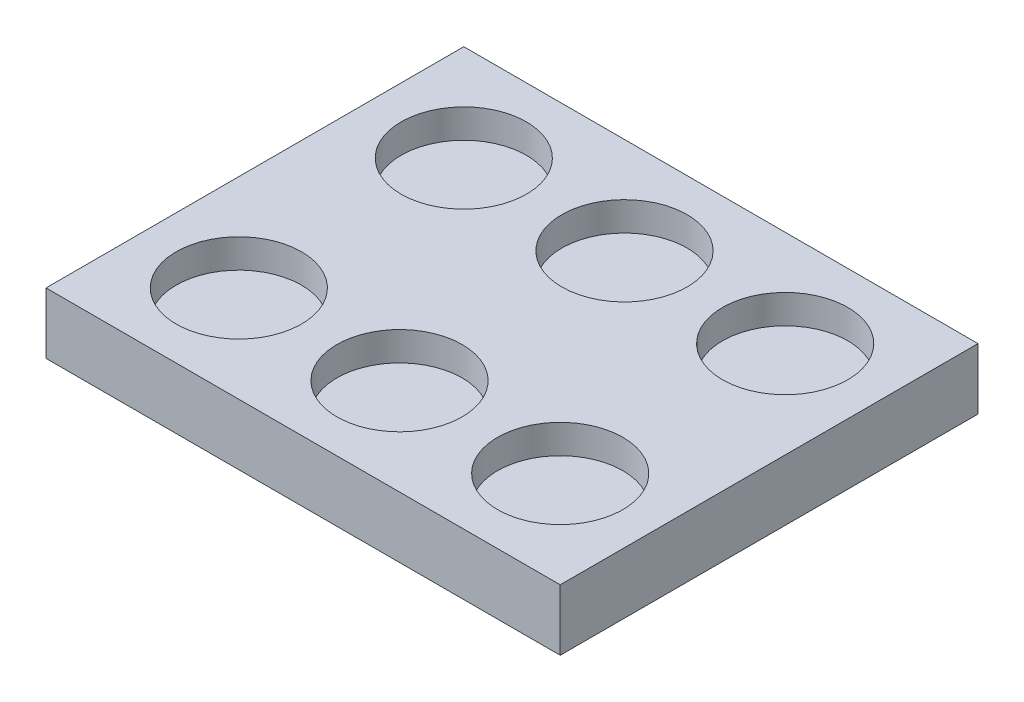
ISO-10303-21;
HEADER;
FILE_DESCRIPTION(('STEP AP214'),'2;1');
FILE_NAME('part.step','',(''),(''),'','','');
FILE_SCHEMA(('AUTOMOTIVE_DESIGN { 1 0 10303 214 1 1 1 1 }'));
ENDSEC;
DATA;
#1=APPLICATION_CONTEXT('core data for automotive mechanical design processes');
#2=APPLICATION_PROTOCOL_DEFINITION('international standard','automotive_design',2000,#1);
#3=PRODUCT_CONTEXT('',#1,'mechanical');
#4=PRODUCT('Part','Part','',(#3));
#5=PRODUCT_RELATED_PRODUCT_CATEGORY('part','',(#4));
#6=PRODUCT_DEFINITION_FORMATION('','',#4);
#7=PRODUCT_DEFINITION_CONTEXT('part definition',#1,'design');
#8=PRODUCT_DEFINITION('design','',#6,#7);
#9=PRODUCT_DEFINITION_SHAPE('','',#8);
#10=(LENGTH_UNIT() NAMED_UNIT(*) SI_UNIT(.MILLI.,.METRE.));
#11=(NAMED_UNIT(*) PLANE_ANGLE_UNIT() SI_UNIT($,.RADIAN.));
#12=(NAMED_UNIT(*) SI_UNIT($,.STERADIAN.) SOLID_ANGLE_UNIT());
#13=UNCERTAINTY_MEASURE_WITH_UNIT(LENGTH_MEASURE(1.E-05),#10,'distance_accuracy_value','');
#14=(GEOMETRIC_REPRESENTATION_CONTEXT(3) GLOBAL_UNCERTAINTY_ASSIGNED_CONTEXT((#13)) GLOBAL_UNIT_ASSIGNED_CONTEXT((#10,
#11,#12)) REPRESENTATION_CONTEXT('',''));
#15=CARTESIAN_POINT('',(0.,0.,0.));
#16=DIRECTION('',(0.,0.,1.));
#17=DIRECTION('',(1.,0.,0.));
#18=AXIS2_PLACEMENT_3D('',#15,#16,#17);
#19=CARTESIAN_POINT('',(0.,1.8,0.));
#20=DIRECTION('',(0.,1.,0.));
#21=DIRECTION('',(0.,0.,1.));
#22=AXIS2_PLACEMENT_3D('',#19,#20,#21);
#23=PLANE('',#22);
#24=CARTESIAN_POINT('',(9.,1.8,7.));
#25=DIRECTION('',(0.,1.,0.));
#26=DIRECTION('',(0.,0.,-1.));
#27=AXIS2_PLACEMENT_3D('',#24,#25,#26);
#28=CIRCLE('',#27,3.9);
#29=CARTESIAN_POINT('',(9.,1.8,3.1));
#30=VERTEX_POINT('',#29);
#31=EDGE_CURVE('E109',#30,#30,#28,.T.);
#32=ORIENTED_EDGE('',*,*,#31,.F.);
#33=EDGE_LOOP('',(#32));
#34=FACE_BOUND('',#33,.T.);
#35=CARTESIAN_POINT('',(-11.,1.8,7.));
#36=DIRECTION('',(0.,1.,0.));
#37=DIRECTION('',(0.,0.,-1.));
#38=AXIS2_PLACEMENT_3D('',#35,#36,#37);
#39=CIRCLE('',#38,3.9);
#40=CARTESIAN_POINT('',(-11.,1.8,3.1));
#41=VERTEX_POINT('',#40);
#42=EDGE_CURVE('E121',#41,#41,#39,.T.);
#43=ORIENTED_EDGE('',*,*,#42,.F.);
#44=EDGE_LOOP('',(#43));
#45=FACE_BOUND('',#44,.T.);
#46=CARTESIAN_POINT('',(-11.,1.8,-7.));
#47=DIRECTION('',(0.,1.,0.));
#48=DIRECTION('',(0.,0.,1.));
#49=AXIS2_PLACEMENT_3D('',#46,#47,#48);
#50=CIRCLE('',#49,3.9);
#51=CARTESIAN_POINT('',(-11.,1.8,-3.1));
#52=VERTEX_POINT('',#51);
#53=EDGE_CURVE('E133',#52,#52,#50,.T.);
#54=ORIENTED_EDGE('',*,*,#53,.F.);
#55=EDGE_LOOP('',(#54));
#56=FACE_BOUND('',#55,.T.);
#57=DIRECTION('',(0.,0.,1.));
#58=VECTOR('',#57,1.);
#59=CARTESIAN_POINT('',(-17.,1.8,-13.));
#60=LINE('',#59,#58);
#61=CARTESIAN_POINT('',(-17.,1.8,-13.));
#62=VERTEX_POINT('',#61);
#63=CARTESIAN_POINT('',(-17.,1.8,13.));
#64=VERTEX_POINT('',#63);
#65=EDGE_CURVE('E82',#62,#64,#60,.T.);
#66=ORIENTED_EDGE('',*,*,#65,.T.);
#67=DIRECTION('',(1.,0.,0.));
#68=VECTOR('',#67,1.);
#69=CARTESIAN_POINT('',(-17.,1.8,13.));
#70=LINE('',#69,#68);
#71=CARTESIAN_POINT('',(15.,1.8,13.));
#72=VERTEX_POINT('',#71);
#73=EDGE_CURVE('E139',#64,#72,#70,.T.);
#74=ORIENTED_EDGE('',*,*,#73,.T.);
#75=DIRECTION('',(0.,0.,-1.));
#76=VECTOR('',#75,1.);
#77=CARTESIAN_POINT('',(15.,1.8,-13.));
#78=LINE('',#77,#76);
#79=CARTESIAN_POINT('',(15.,1.8,-13.));
#80=VERTEX_POINT('',#79);
#81=EDGE_CURVE('E57',#72,#80,#78,.T.);
#82=ORIENTED_EDGE('',*,*,#81,.T.);
#83=DIRECTION('',(-1.,0.,0.));
#84=VECTOR('',#83,1.);
#85=CARTESIAN_POINT('',(-17.,1.8,-13.));
#86=LINE('',#85,#84);
#87=EDGE_CURVE('E52',#80,#62,#86,.T.);
#88=ORIENTED_EDGE('',*,*,#87,.T.);
#89=EDGE_LOOP('',(#66,#74,#82,#88));
#90=FACE_BOUND('',#89,.T.);
#91=CARTESIAN_POINT('',(9.,1.8,-7.));
#92=DIRECTION('',(0.,1.,0.));
#93=DIRECTION('',(0.,0.,1.));
#94=AXIS2_PLACEMENT_3D('',#91,#92,#93);
#95=CIRCLE('',#94,3.9);
#96=CARTESIAN_POINT('',(9.,1.8,-3.1));
#97=VERTEX_POINT('',#96);
#98=EDGE_CURVE('E127',#97,#97,#95,.T.);
#99=ORIENTED_EDGE('',*,*,#98,.F.);
#100=EDGE_LOOP('',(#99));
#101=FACE_BOUND('',#100,.T.);
#102=CARTESIAN_POINT('',(-1.,1.8,7.));
#103=DIRECTION('',(0.,1.,0.));
#104=DIRECTION('',(0.,0.,-1.));
#105=AXIS2_PLACEMENT_3D('',#102,#103,#104);
#106=CIRCLE('',#105,3.9);
#107=CARTESIAN_POINT('',(-1.,1.8,3.1));
#108=VERTEX_POINT('',#107);
#109=EDGE_CURVE('E115',#108,#108,#106,.T.);
#110=ORIENTED_EDGE('',*,*,#109,.F.);
#111=EDGE_LOOP('',(#110));
#112=FACE_BOUND('',#111,.T.);
#113=CARTESIAN_POINT('',(-1.,1.8,-7.));
#114=DIRECTION('',(0.,1.,0.));
#115=DIRECTION('',(0.,0.,1.));
#116=AXIS2_PLACEMENT_3D('',#113,#114,#115);
#117=CIRCLE('',#116,3.9);
#118=CARTESIAN_POINT('',(-1.,1.8,-3.1));
#119=VERTEX_POINT('',#118);
#120=EDGE_CURVE('E103',#119,#119,#117,.T.);
#121=ORIENTED_EDGE('',*,*,#120,.F.);
#122=EDGE_LOOP('',(#121));
#123=FACE_BOUND('',#122,.T.);
#124=ADVANCED_FACE('F37',(#34,#45,#56,#90,#101,#112,#123),#23,.T.);
#125=CARTESIAN_POINT('',(-17.,1.8,-13.));
#126=DIRECTION('',(1.,0.,0.));
#127=DIRECTION('',(0.,0.,-1.));
#128=AXIS2_PLACEMENT_3D('',#125,#126,#127);
#129=PLANE('',#128);
#130=DIRECTION('',(0.,-1.,0.));
#131=VECTOR('',#130,1.);
#132=CARTESIAN_POINT('',(-17.,1.8,-13.));
#133=LINE('',#132,#131);
#134=CARTESIAN_POINT('',(-17.,-2.,-13.));
#135=VERTEX_POINT('',#134);
#136=EDGE_CURVE('E77',#62,#135,#133,.T.);
#137=ORIENTED_EDGE('',*,*,#136,.T.);
#138=DIRECTION('',(0.,0.,-1.));
#139=VECTOR('',#138,1.);
#140=CARTESIAN_POINT('',(-17.,-2.,13.));
#141=LINE('',#140,#139);
#142=CARTESIAN_POINT('',(-17.,-2.,13.));
#143=VERTEX_POINT('',#142);
#144=EDGE_CURVE('E81',#143,#135,#141,.T.);
#145=ORIENTED_EDGE('',*,*,#144,.F.);
#146=DIRECTION('',(0.,-1.,0.));
#147=VECTOR('',#146,1.);
#148=CARTESIAN_POINT('',(-17.,1.8,13.));
#149=LINE('',#148,#147);
#150=EDGE_CURVE('E11',#64,#143,#149,.T.);
#151=ORIENTED_EDGE('',*,*,#150,.F.);
#152=ORIENTED_EDGE('',*,*,#65,.F.);
#153=EDGE_LOOP('',(#137,#145,#151,#152));
#154=FACE_BOUND('',#153,.T.);
#155=ADVANCED_FACE('F39',(#154),#129,.F.);
#156=CARTESIAN_POINT('',(-17.,1.8,13.));
#157=DIRECTION('',(0.,0.,-1.));
#158=DIRECTION('',(-1.,0.,0.));
#159=AXIS2_PLACEMENT_3D('',#156,#157,#158);
#160=PLANE('',#159);
#161=ORIENTED_EDGE('',*,*,#150,.T.);
#162=DIRECTION('',(-1.,0.,0.));
#163=VECTOR('',#162,1.);
#164=CARTESIAN_POINT('',(-17.,-2.,13.));
#165=LINE('',#164,#163);
#166=CARTESIAN_POINT('',(15.,-2.,13.));
#167=VERTEX_POINT('',#166);
#168=EDGE_CURVE('E97',#167,#143,#165,.T.);
#169=ORIENTED_EDGE('',*,*,#168,.F.);
#170=DIRECTION('',(0.,-1.,0.));
#171=VECTOR('',#170,1.);
#172=CARTESIAN_POINT('',(15.,1.8,13.));
#173=LINE('',#172,#171);
#174=EDGE_CURVE('E45',#72,#167,#173,.T.);
#175=ORIENTED_EDGE('',*,*,#174,.F.);
#176=ORIENTED_EDGE('',*,*,#73,.F.);
#177=EDGE_LOOP('',(#161,#169,#175,#176));
#178=FACE_BOUND('',#177,.T.);
#179=ADVANCED_FACE('F147',(#178),#160,.F.);
#180=CARTESIAN_POINT('',(15.,1.8,-13.));
#181=DIRECTION('',(-1.,0.,0.));
#182=DIRECTION('',(0.,0.,1.));
#183=AXIS2_PLACEMENT_3D('',#180,#181,#182);
#184=PLANE('',#183);
#185=ORIENTED_EDGE('',*,*,#174,.T.);
#186=DIRECTION('',(0.,0.,1.));
#187=VECTOR('',#186,1.);
#188=CARTESIAN_POINT('',(15.,-2.,13.));
#189=LINE('',#188,#187);
#190=CARTESIAN_POINT('',(15.,-2.,-13.));
#191=VERTEX_POINT('',#190);
#192=EDGE_CURVE('E92',#191,#167,#189,.T.);
#193=ORIENTED_EDGE('',*,*,#192,.F.);
#194=DIRECTION('',(0.,-1.,0.));
#195=VECTOR('',#194,1.);
#196=CARTESIAN_POINT('',(15.,1.8,-13.));
#197=LINE('',#196,#195);
#198=EDGE_CURVE('E84',#80,#191,#197,.T.);
#199=ORIENTED_EDGE('',*,*,#198,.F.);
#200=ORIENTED_EDGE('',*,*,#81,.F.);
#201=EDGE_LOOP('',(#185,#193,#199,#200));
#202=FACE_BOUND('',#201,.T.);
#203=ADVANCED_FACE('F145',(#202),#184,.F.);
#204=CARTESIAN_POINT('',(-17.,1.8,-13.));
#205=DIRECTION('',(0.,0.,1.));
#206=DIRECTION('',(1.,0.,0.));
#207=AXIS2_PLACEMENT_3D('',#204,#205,#206);
#208=PLANE('',#207);
#209=ORIENTED_EDGE('',*,*,#198,.T.);
#210=DIRECTION('',(1.,0.,0.));
#211=VECTOR('',#210,1.);
#212=CARTESIAN_POINT('',(-17.,-2.,-13.));
#213=LINE('',#212,#211);
#214=EDGE_CURVE('E87',#135,#191,#213,.T.);
#215=ORIENTED_EDGE('',*,*,#214,.F.);
#216=ORIENTED_EDGE('',*,*,#136,.F.);
#217=ORIENTED_EDGE('',*,*,#87,.F.);
#218=EDGE_LOOP('',(#209,#215,#216,#217));
#219=FACE_BOUND('',#218,.T.);
#220=ADVANCED_FACE('F88',(#219),#208,.F.);
#221=CARTESIAN_POINT('',(-11.,1.8,-7.));
#222=DIRECTION('',(0.,-1.,0.));
#223=DIRECTION('',(0.,0.,-1.));
#224=AXIS2_PLACEMENT_3D('',#221,#222,#223);
#225=CYLINDRICAL_SURFACE('',#224,3.9);
#226=ORIENTED_EDGE('',*,*,#53,.T.);
#227=EDGE_LOOP('',(#226));
#228=FACE_BOUND('',#227,.T.);
#229=CARTESIAN_POINT('',(-11.,0.,-7.));
#230=DIRECTION('',(0.,1.,0.));
#231=DIRECTION('',(0.,0.,1.));
#232=AXIS2_PLACEMENT_3D('',#229,#230,#231);
#233=CIRCLE('',#232,3.9);
#234=CARTESIAN_POINT('',(-11.,0.,-3.1));
#235=VERTEX_POINT('',#234);
#236=EDGE_CURVE('E130',#235,#235,#233,.T.);
#237=ORIENTED_EDGE('',*,*,#236,.F.);
#238=EDGE_LOOP('',(#237));
#239=FACE_BOUND('',#238,.T.);
#240=ADVANCED_FACE('F187',(#228,#239),#225,.F.);
#241=CARTESIAN_POINT('',(9.,1.8,-7.));
#242=DIRECTION('',(0.,-1.,0.));
#243=DIRECTION('',(0.,0.,-1.));
#244=AXIS2_PLACEMENT_3D('',#241,#242,#243);
#245=CYLINDRICAL_SURFACE('',#244,3.9);
#246=ORIENTED_EDGE('',*,*,#98,.T.);
#247=EDGE_LOOP('',(#246));
#248=FACE_BOUND('',#247,.T.);
#249=CARTESIAN_POINT('',(9.,0.,-7.));
#250=DIRECTION('',(0.,1.,0.));
#251=DIRECTION('',(0.,0.,1.));
#252=AXIS2_PLACEMENT_3D('',#249,#250,#251);
#253=CIRCLE('',#252,3.9);
#254=CARTESIAN_POINT('',(9.,0.,-3.1));
#255=VERTEX_POINT('',#254);
#256=EDGE_CURVE('E124',#255,#255,#253,.T.);
#257=ORIENTED_EDGE('',*,*,#256,.F.);
#258=EDGE_LOOP('',(#257));
#259=FACE_BOUND('',#258,.T.);
#260=ADVANCED_FACE('F189',(#248,#259),#245,.F.);
#261=CARTESIAN_POINT('',(-11.,1.8,7.));
#262=DIRECTION('',(0.,-1.,0.));
#263=DIRECTION('',(0.,0.,-1.));
#264=AXIS2_PLACEMENT_3D('',#261,#262,#263);
#265=CYLINDRICAL_SURFACE('',#264,3.9);
#266=ORIENTED_EDGE('',*,*,#42,.T.);
#267=EDGE_LOOP('',(#266));
#268=FACE_BOUND('',#267,.T.);
#269=CARTESIAN_POINT('',(-11.,0.,7.));
#270=DIRECTION('',(0.,1.,0.));
#271=DIRECTION('',(0.,0.,-1.));
#272=AXIS2_PLACEMENT_3D('',#269,#270,#271);
#273=CIRCLE('',#272,3.9);
#274=CARTESIAN_POINT('',(-11.,0.,3.1));
#275=VERTEX_POINT('',#274);
#276=EDGE_CURVE('E118',#275,#275,#273,.T.);
#277=ORIENTED_EDGE('',*,*,#276,.F.);
#278=EDGE_LOOP('',(#277));
#279=FACE_BOUND('',#278,.T.);
#280=ADVANCED_FACE('F196',(#268,#279),#265,.F.);
#281=CARTESIAN_POINT('',(-1.,1.8,7.));
#282=DIRECTION('',(0.,-1.,0.));
#283=DIRECTION('',(0.,0.,-1.));
#284=AXIS2_PLACEMENT_3D('',#281,#282,#283);
#285=CYLINDRICAL_SURFACE('',#284,3.9);
#286=ORIENTED_EDGE('',*,*,#109,.T.);
#287=EDGE_LOOP('',(#286));
#288=FACE_BOUND('',#287,.T.);
#289=CARTESIAN_POINT('',(-1.,0.,7.));
#290=DIRECTION('',(0.,1.,0.));
#291=DIRECTION('',(0.,0.,-1.));
#292=AXIS2_PLACEMENT_3D('',#289,#290,#291);
#293=CIRCLE('',#292,3.9);
#294=CARTESIAN_POINT('',(-1.,0.,3.1));
#295=VERTEX_POINT('',#294);
#296=EDGE_CURVE('E112',#295,#295,#293,.T.);
#297=ORIENTED_EDGE('',*,*,#296,.F.);
#298=EDGE_LOOP('',(#297));
#299=FACE_BOUND('',#298,.T.);
#300=ADVANCED_FACE('F238',(#288,#299),#285,.F.);
#301=CARTESIAN_POINT('',(9.,1.8,7.));
#302=DIRECTION('',(0.,-1.,0.));
#303=DIRECTION('',(0.,0.,-1.));
#304=AXIS2_PLACEMENT_3D('',#301,#302,#303);
#305=CYLINDRICAL_SURFACE('',#304,3.9);
#306=ORIENTED_EDGE('',*,*,#31,.T.);
#307=EDGE_LOOP('',(#306));
#308=FACE_BOUND('',#307,.T.);
#309=CARTESIAN_POINT('',(9.,0.,7.));
#310=DIRECTION('',(0.,1.,0.));
#311=DIRECTION('',(0.,0.,-1.));
#312=AXIS2_PLACEMENT_3D('',#309,#310,#311);
#313=CIRCLE('',#312,3.9);
#314=CARTESIAN_POINT('',(9.,0.,3.1));
#315=VERTEX_POINT('',#314);
#316=EDGE_CURVE('E106',#315,#315,#313,.T.);
#317=ORIENTED_EDGE('',*,*,#316,.F.);
#318=EDGE_LOOP('',(#317));
#319=FACE_BOUND('',#318,.T.);
#320=ADVANCED_FACE('F162',(#308,#319),#305,.F.);
#321=CARTESIAN_POINT('',(-1.,1.8,-7.));
#322=DIRECTION('',(0.,-1.,0.));
#323=DIRECTION('',(0.,0.,-1.));
#324=AXIS2_PLACEMENT_3D('',#321,#322,#323);
#325=CYLINDRICAL_SURFACE('',#324,3.9);
#326=ORIENTED_EDGE('',*,*,#120,.T.);
#327=EDGE_LOOP('',(#326));
#328=FACE_BOUND('',#327,.T.);
#329=CARTESIAN_POINT('',(-1.,0.,-7.));
#330=DIRECTION('',(0.,1.,0.));
#331=DIRECTION('',(0.,0.,1.));
#332=AXIS2_PLACEMENT_3D('',#329,#330,#331);
#333=CIRCLE('',#332,3.9);
#334=CARTESIAN_POINT('',(-1.,0.,-3.1));
#335=VERTEX_POINT('',#334);
#336=EDGE_CURVE('E102',#335,#335,#333,.T.);
#337=ORIENTED_EDGE('',*,*,#336,.F.);
#338=EDGE_LOOP('',(#337));
#339=FACE_BOUND('',#338,.T.);
#340=ADVANCED_FACE('F158',(#328,#339),#325,.F.);
#341=CARTESIAN_POINT('',(0.,0.,0.));
#342=DIRECTION('',(0.,-1.,0.));
#343=DIRECTION('',(0.,0.,-1.));
#344=AXIS2_PLACEMENT_3D('',#341,#342,#343);
#345=PLANE('',#344);
#346=ORIENTED_EDGE('',*,*,#336,.T.);
#347=EDGE_LOOP('',(#346));
#348=FACE_BOUND('',#347,.T.);
#349=ADVANCED_FACE('F161',(#348),#345,.F.);
#350=ORIENTED_EDGE('',*,*,#316,.T.);
#351=EDGE_LOOP('',(#350));
#352=FACE_BOUND('',#351,.T.);
#353=ADVANCED_FACE('F167',(#352),#345,.F.);
#354=ORIENTED_EDGE('',*,*,#296,.T.);
#355=EDGE_LOOP('',(#354));
#356=FACE_BOUND('',#355,.T.);
#357=ADVANCED_FACE('F173',(#356),#345,.F.);
#358=ORIENTED_EDGE('',*,*,#276,.T.);
#359=EDGE_LOOP('',(#358));
#360=FACE_BOUND('',#359,.T.);
#361=ADVANCED_FACE('F183',(#360),#345,.F.);
#362=ORIENTED_EDGE('',*,*,#256,.T.);
#363=EDGE_LOOP('',(#362));
#364=FACE_BOUND('',#363,.T.);
#365=ADVANCED_FACE('F177',(#364),#345,.F.);
#366=ORIENTED_EDGE('',*,*,#236,.T.);
#367=EDGE_LOOP('',(#366));
#368=FACE_BOUND('',#367,.T.);
#369=ADVANCED_FACE('F169',(#368),#345,.F.);
#370=CARTESIAN_POINT('',(0.,-2.,0.));
#371=DIRECTION('',(0.,-1.,0.));
#372=DIRECTION('',(0.,0.,-1.));
#373=AXIS2_PLACEMENT_3D('',#370,#371,#372);
#374=PLANE('',#373);
#375=ORIENTED_EDGE('',*,*,#144,.T.);
#376=ORIENTED_EDGE('',*,*,#214,.T.);
#377=ORIENTED_EDGE('',*,*,#192,.T.);
#378=ORIENTED_EDGE('',*,*,#168,.T.);
#379=EDGE_LOOP('',(#375,#376,#377,#378));
#380=FACE_BOUND('',#379,.T.);
#381=ADVANCED_FACE('F95',(#380),#374,.T.);
#382=CLOSED_SHELL('',(#124,#155,#179,#203,#220,#240,#260,#280,#300,#320,#340,#349,#353,#357,
#361,#365,#369,#381));
#383=MANIFOLD_SOLID_BREP('B2',#382);
#384=ADVANCED_BREP_SHAPE_REPRESENTATION('',(#18,#383),#14);
#385=SHAPE_DEFINITION_REPRESENTATION(#9,#384);
ENDSEC;
END-ISO-10303-21;
